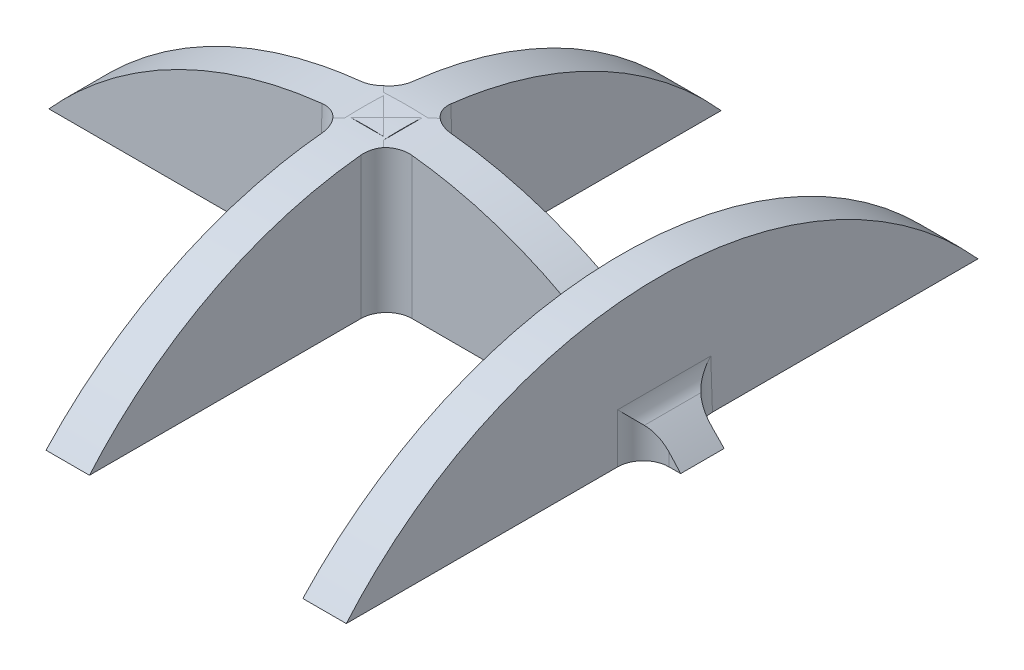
ISO-10303-21;
HEADER;
FILE_DESCRIPTION(('STEP AP214'),'2;1');
FILE_NAME('part.step','',(''),(''),'','','');
FILE_SCHEMA(('AUTOMOTIVE_DESIGN { 1 0 10303 214 1 1 1 1 }'));
ENDSEC;
DATA;
#1=APPLICATION_CONTEXT('core data for automotive mechanical design processes');
#2=APPLICATION_PROTOCOL_DEFINITION('international standard','automotive_design',2000,#1);
#3=PRODUCT_CONTEXT('',#1,'mechanical');
#4=PRODUCT('Part','Part','',(#3));
#5=PRODUCT_RELATED_PRODUCT_CATEGORY('part','',(#4));
#6=PRODUCT_DEFINITION_FORMATION('','',#4);
#7=PRODUCT_DEFINITION_CONTEXT('part definition',#1,'design');
#8=PRODUCT_DEFINITION('design','',#6,#7);
#9=PRODUCT_DEFINITION_SHAPE('','',#8);
#10=(LENGTH_UNIT() NAMED_UNIT(*) SI_UNIT(.MILLI.,.METRE.));
#11=(NAMED_UNIT(*) PLANE_ANGLE_UNIT() SI_UNIT($,.RADIAN.));
#12=(NAMED_UNIT(*) SI_UNIT($,.STERADIAN.) SOLID_ANGLE_UNIT());
#13=UNCERTAINTY_MEASURE_WITH_UNIT(LENGTH_MEASURE(1.E-05),#10,'distance_accuracy_value','');
#14=(GEOMETRIC_REPRESENTATION_CONTEXT(3) GLOBAL_UNCERTAINTY_ASSIGNED_CONTEXT((#13)) GLOBAL_UNIT_ASSIGNED_CONTEXT((#10,
#11,#12)) REPRESENTATION_CONTEXT('',''));
#15=CARTESIAN_POINT('',(0.,0.,0.));
#16=DIRECTION('',(0.,0.,1.));
#17=DIRECTION('',(1.,0.,0.));
#18=AXIS2_PLACEMENT_3D('',#15,#16,#17);
#19=CARTESIAN_POINT('',(1.5,33.,0.226449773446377));
#20=DIRECTION('',(0.999847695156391,0.0174524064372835,0.));
#21=DIRECTION('',(-0.0174524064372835,0.999847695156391,0.));
#22=AXIS2_PLACEMENT_3D('',#19,#20,#21);
#23=PLANE('',#22);
#24=DIRECTION('',(0.,0.,-1.));
#25=VECTOR('',#24,1.);
#26=CARTESIAN_POINT('',(1.69200571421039,22.,-24.3702979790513));
#27=LINE('',#26,#25);
#28=CARTESIAN_POINT('',(1.69200571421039,22.,3.69170110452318));
#29=VERTEX_POINT('',#28);
#30=CARTESIAN_POINT('',(1.6920057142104,22.,24.8231975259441));
#31=VERTEX_POINT('',#30);
#32=EDGE_CURVE('E280',#29,#31,#27,.F.);
#33=ORIENTED_EDGE('',*,*,#32,.F.);
#34=DIRECTION('',(0.0174497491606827,-0.999695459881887,0.0174497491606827));
#35=VECTOR('',#34,1.);
#36=CARTESIAN_POINT('',(1.49900331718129,33.0570999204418,3.49869870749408));
#37=LINE('',#36,#35);
#38=CARTESIAN_POINT('',(1.50284553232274,32.8369795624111,3.50254092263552));
#39=VERTEX_POINT('',#38);
#40=EDGE_CURVE('E379',#29,#39,#37,.F.);
#41=ORIENTED_EDGE('',*,*,#40,.T.);
#42=CARTESIAN_POINT('',(2.07601714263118,0.,0.226449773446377));
#43=DIRECTION('',(0.999847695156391,0.0174524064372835,0.));
#44=DIRECTION('',(0.0174524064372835,-0.999847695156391,0.));
#45=AXIS2_PLACEMENT_3D('',#42,#43,#44);
#46=ELLIPSE('',#45,33.005026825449,33.);
#47=EDGE_CURVE('E278',#31,#39,#46,.F.);
#48=ORIENTED_EDGE('',*,*,#47,.F.);
#49=EDGE_LOOP('',(#33,#41,#48));
#50=FACE_BOUND('',#49,.T.);
#51=ADVANCED_FACE('F29',(#50),#23,.T.);
#52=CARTESIAN_POINT('',(-1.5,33.,0.226449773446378));
#53=DIRECTION('',(-0.999847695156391,0.0174524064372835,0.));
#54=DIRECTION('',(-0.0174524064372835,-0.999847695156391,0.));
#55=AXIS2_PLACEMENT_3D('',#52,#53,#54);
#56=PLANE('',#55);
#57=CARTESIAN_POINT('',(-2.07601714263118,0.,0.226449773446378));
#58=DIRECTION('',(-0.999847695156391,0.0174524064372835,0.));
#59=DIRECTION('',(0.0174524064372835,0.999847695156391,0.));
#60=AXIS2_PLACEMENT_3D('',#57,#58,#59);
#61=ELLIPSE('',#60,33.005026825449,33.);
#62=CARTESIAN_POINT('',(-1.69200571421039,22.,24.8231975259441));
#63=VERTEX_POINT('',#62);
#64=CARTESIAN_POINT('',(-1.50284553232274,32.8369795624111,3.50254092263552));
#65=VERTEX_POINT('',#64);
#66=EDGE_CURVE('E286',#63,#65,#61,.T.);
#67=ORIENTED_EDGE('',*,*,#66,.T.);
#68=DIRECTION('',(-0.0174497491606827,-0.999695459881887,0.0174497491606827));
#69=VECTOR('',#68,1.);
#70=CARTESIAN_POINT('',(-1.6913968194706,22.0348835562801,3.69109220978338));
#71=LINE('',#70,#69);
#72=CARTESIAN_POINT('',(-1.69200571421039,22.,3.69170110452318));
#73=VERTEX_POINT('',#72);
#74=EDGE_CURVE('E375',#65,#73,#71,.T.);
#75=ORIENTED_EDGE('',*,*,#74,.T.);
#76=DIRECTION('',(0.,0.,1.));
#77=VECTOR('',#76,1.);
#78=CARTESIAN_POINT('',(-1.6920057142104,22.,-24.3702979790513));
#79=LINE('',#78,#77);
#80=EDGE_CURVE('E289',#73,#63,#79,.T.);
#81=ORIENTED_EDGE('',*,*,#80,.T.);
#82=EDGE_LOOP('',(#67,#75,#81));
#83=FACE_BOUND('',#82,.T.);
#84=ADVANCED_FACE('F463',(#83),#56,.T.);
#85=CARTESIAN_POINT('',(0.,33.,-1.5));
#86=DIRECTION('',(0.,0.0174524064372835,-0.999847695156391));
#87=DIRECTION('',(0.,0.999847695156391,0.0174524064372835));
#88=AXIS2_PLACEMENT_3D('',#85,#86,#87);
#89=PLANE('',#88);
#90=CARTESIAN_POINT('',(16.4628041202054,30.8865032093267,-1.53689122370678));
#91=DIRECTION('',(0.,0.0174524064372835,-0.999847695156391));
#92=DIRECTION('',(0.,-0.999847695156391,-0.0174524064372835));
#93=AXIS2_PLACEMENT_3D('',#90,#91,#92);
#94=ELLIPSE('',#93,2.00030465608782,2.);
#95=CARTESIAN_POINT('',(15.5220724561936,29.1215601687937,-1.56769841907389));
#96=VERTEX_POINT('',#95);
#97=CARTESIAN_POINT('',(16.4285083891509,28.8867972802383,-1.57179622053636));
#98=VERTEX_POINT('',#97);
#99=EDGE_CURVE('E420',#96,#98,#94,.F.);
#100=ORIENTED_EDGE('',*,*,#99,.T.);
#101=DIRECTION('',(-0.0174497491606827,-0.999695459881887,-0.0174497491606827));
#102=VECTOR('',#101,1.);
#103=CARTESIAN_POINT('',(16.4952803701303,32.7121615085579,-1.50502423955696));
#104=LINE('',#103,#102);
#105=CARTESIAN_POINT('',(16.3082988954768,22.,-1.69200571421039));
#106=VERTEX_POINT('',#105);
#107=EDGE_CURVE('E363',#98,#106,#104,.T.);
#108=ORIENTED_EDGE('',*,*,#107,.T.);
#109=DIRECTION('',(-1.,0.,0.));
#110=VECTOR('',#109,1.);
#111=CARTESIAN_POINT('',(-24.5967477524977,22.,-1.69200571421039));
#112=LINE('',#111,#110);
#113=CARTESIAN_POINT('',(3.69170110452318,22.,-1.69200571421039));
#114=VERTEX_POINT('',#113);
#115=EDGE_CURVE('E329',#114,#106,#112,.F.);
#116=ORIENTED_EDGE('',*,*,#115,.F.);
#117=DIRECTION('',(-0.0174497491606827,0.999695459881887,0.0174497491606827));
#118=VECTOR('',#117,1.);
#119=CARTESIAN_POINT('',(3.49987604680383,32.9896501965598,-1.50018065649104));
#120=LINE('',#119,#118);
#121=CARTESIAN_POINT('',(3.50294981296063,32.8135542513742,-1.50325442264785));
#122=VERTEX_POINT('',#121);
#123=EDGE_CURVE('E361',#114,#122,#120,.T.);
#124=ORIENTED_EDGE('',*,*,#123,.T.);
#125=CARTESIAN_POINT('',(0.,0.,-2.07601714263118));
#126=DIRECTION('',(0.,0.0174524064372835,-0.999847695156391));
#127=DIRECTION('',(0.,-0.999847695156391,-0.0174524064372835));
#128=AXIS2_PLACEMENT_3D('',#125,#126,#127);
#129=ELLIPSE('',#128,33.005026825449,33.);
#130=EDGE_CURVE('E325',#96,#122,#129,.F.);
#131=ORIENTED_EDGE('',*,*,#130,.F.);
#132=EDGE_LOOP('',(#100,#108,#116,#124,#131));
#133=FACE_BOUND('',#132,.T.);
#134=ADVANCED_FACE('F472',(#133),#89,.T.);
#135=CARTESIAN_POINT('',(-3.50294981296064,32.8135542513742,-1.50325442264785));
#136=VERTEX_POINT('',#135);
#137=CARTESIAN_POINT('',(-24.5967477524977,22.,-1.69200571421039));
#138=VERTEX_POINT('',#137);
#139=EDGE_CURVE('E277',#136,#138,#129,.F.);
#140=ORIENTED_EDGE('',*,*,#139,.F.);
#141=DIRECTION('',(-0.0174497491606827,-0.999695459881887,-0.0174497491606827));
#142=VECTOR('',#141,1.);
#143=CARTESIAN_POINT('',(-3.49862975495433,33.0610502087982,-1.49893436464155));
#144=LINE('',#143,#142);
#145=CARTESIAN_POINT('',(-3.69170110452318,22.,-1.69200571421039));
#146=VERTEX_POINT('',#145);
#147=EDGE_CURVE('E359',#136,#146,#144,.T.);
#148=ORIENTED_EDGE('',*,*,#147,.T.);
#149=EDGE_CURVE('E326',#138,#146,#112,.F.);
#150=ORIENTED_EDGE('',*,*,#149,.F.);
#151=EDGE_LOOP('',(#140,#148,#150));
#152=FACE_BOUND('',#151,.T.);
#153=ADVANCED_FACE('F633',(#152),#89,.T.);
#154=CARTESIAN_POINT('',(0.,0.,1.5));
#155=DIRECTION('',(0.,0.,-1.));
#156=DIRECTION('',(-1.,0.,0.));
#157=AXIS2_PLACEMENT_3D('',#154,#155,#156);
#158=CYLINDRICAL_SURFACE('',#157,33.);
#159=CARTESIAN_POINT('',(23.6744276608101,22.9895949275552,-1.67473227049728));
#160=CARTESIAN_POINT('',(23.5970089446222,23.0693281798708,-1.6733632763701));
#161=CARTESIAN_POINT('',(23.5191105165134,23.1487331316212,-1.67629203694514));
#162=CARTESIAN_POINT('',(23.3627919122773,23.3064842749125,-1.69124154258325));
#163=CARTESIAN_POINT('',(23.2843709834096,23.3848278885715,-1.7032813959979));
#164=CARTESIAN_POINT('',(23.1301055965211,23.5374096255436,-1.73645834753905));
#165=CARTESIAN_POINT('',(23.0542539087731,23.6117005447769,-1.75731408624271));
#166=CARTESIAN_POINT('',(22.9036030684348,23.7578612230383,-1.80860705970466));
#167=CARTESIAN_POINT('',(22.8288029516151,23.8297332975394,-1.83903482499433));
#168=CARTESIAN_POINT('',(22.6720332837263,23.9789902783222,-1.91451080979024));
#169=CARTESIAN_POINT('',(22.5903056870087,24.0559744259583,-1.96089197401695));
#170=CARTESIAN_POINT('',(22.4702348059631,24.1679876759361,-2.04129381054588));
#171=CARTESIAN_POINT('',(22.4303076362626,24.2050437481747,-2.07018851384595));
#172=CARTESIAN_POINT('',(22.351820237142,24.277540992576,-2.1317055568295));
#173=CARTESIAN_POINT('',(22.3132609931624,24.3129810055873,-2.16433051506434));
#174=CARTESIAN_POINT('',(22.2755450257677,24.3474863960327,-2.19887554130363));
#175=B_SPLINE_CURVE_WITH_KNOTS('',3,(#159,#160,#161,#162,#163,#164,#165,#166,#167,#168,#169,
#170,#171,#172,#173,#174),.UNSPECIFIED.,.F.,.F.,(4,2,2,2,2,2,2,4),(0.,0.333414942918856,
0.667531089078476,0.991705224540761,1.31555966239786,1.67902059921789,1.86387605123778,
2.04886207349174),.UNSPECIFIED.);
#176=CARTESIAN_POINT('',(23.6744276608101,22.9895949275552,-1.67473227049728));
#177=VERTEX_POINT('',#176);
#178=CARTESIAN_POINT('',(22.2755450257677,24.3474863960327,-2.19887554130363));
#179=VERTEX_POINT('',#178);
#180=EDGE_CURVE('E383',#177,#179,#175,.T.);
#181=ORIENTED_EDGE('',*,*,#180,.T.);
#182=DIRECTION('',(0.,0.,-1.));
#183=VECTOR('',#182,1.);
#184=CARTESIAN_POINT('',(22.2755450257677,24.3474863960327,1.5));
#185=LINE('',#184,#183);
#186=CARTESIAN_POINT('',(22.2755450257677,24.3474863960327,2.19887554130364));
#187=VERTEX_POINT('',#186);
#188=EDGE_CURVE('E346',#179,#187,#185,.F.);
#189=ORIENTED_EDGE('',*,*,#188,.T.);
#190=CARTESIAN_POINT('',(22.2755450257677,24.3474863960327,2.19887554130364));
#191=CARTESIAN_POINT('',(22.3282730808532,24.2992511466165,2.1505920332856));
#192=CARTESIAN_POINT('',(22.3826349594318,24.2491954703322,2.10605567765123));
#193=CARTESIAN_POINT('',(22.4937555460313,24.1461511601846,2.02421230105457));
#194=CARTESIAN_POINT('',(22.5505100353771,24.0931676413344,1.98689315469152));
#195=CARTESIAN_POINT('',(22.6644844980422,23.9859782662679,1.91979055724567));
#196=CARTESIAN_POINT('',(22.7216679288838,23.9318235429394,1.88986172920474));
#197=CARTESIAN_POINT('',(22.8371554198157,23.8216435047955,1.83617377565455));
#198=CARTESIAN_POINT('',(22.8954599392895,23.7656174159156,1.81241723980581));
#199=CARTESIAN_POINT('',(23.0130458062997,23.6517749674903,1.77066393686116));
#200=CARTESIAN_POINT('',(23.07233080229,23.593950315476,1.75270029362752));
#201=CARTESIAN_POINT('',(23.1911847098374,23.4771356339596,1.72243241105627));
#202=CARTESIAN_POINT('',(23.2507536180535,23.4181456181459,1.71012810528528));
#203=CARTESIAN_POINT('',(23.3712133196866,23.2979351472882,1.69071237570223));
#204=CARTESIAN_POINT('',(23.4321035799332,23.2366944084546,1.68372452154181));
#205=CARTESIAN_POINT('',(23.5535652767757,23.1135690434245,1.67519784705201));
#206=CARTESIAN_POINT('',(23.6141368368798,23.0516846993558,1.67365673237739));
#207=CARTESIAN_POINT('',(23.6744276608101,22.9895949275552,1.67473227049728));
#208=B_SPLINE_CURVE_WITH_KNOTS('',3,(#190,#191,#192,#193,#194,#195,#196,#197,#198,#199,#200,
#201,#202,#203,#204,#205,#206,#207),.UNSPECIFIED.,.F.,.F.,(4,2,2,2,2,2,2,2,4),(0.,
0.258502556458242,0.516566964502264,0.7690564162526,1.02165163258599,1.27566658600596,
1.5296785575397,1.78942792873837,2.04906787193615),.UNSPECIFIED.);
#209=CARTESIAN_POINT('',(23.6744276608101,22.9895949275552,1.67473227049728));
#210=VERTEX_POINT('',#209);
#211=EDGE_CURVE('E415',#187,#210,#208,.T.);
#212=ORIENTED_EDGE('',*,*,#211,.T.);
#213=CARTESIAN_POINT('',(0.,0.,2.07601714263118));
#214=DIRECTION('',(0.,0.0174524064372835,0.999847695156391));
#215=DIRECTION('',(0.,0.999847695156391,-0.0174524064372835));
#216=AXIS2_PLACEMENT_3D('',#213,#214,#215);
#217=ELLIPSE('',#216,33.005026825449,33.);
#218=CARTESIAN_POINT('',(24.5967477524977,22.,1.69200571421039));
#219=VERTEX_POINT('',#218);
#220=EDGE_CURVE('E330',#219,#210,#217,.T.);
#221=ORIENTED_EDGE('',*,*,#220,.F.);
#222=DIRECTION('',(0.,0.,-1.));
#223=VECTOR('',#222,1.);
#224=CARTESIAN_POINT('',(24.5967477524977,22.,1.5));
#225=LINE('',#224,#223);
#226=CARTESIAN_POINT('',(24.5967477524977,22.,-1.69200571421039));
#227=VERTEX_POINT('',#226);
#228=EDGE_CURVE('E314',#219,#227,#225,.T.);
#229=ORIENTED_EDGE('',*,*,#228,.T.);
#230=EDGE_CURVE('E321',#227,#177,#129,.F.);
#231=ORIENTED_EDGE('',*,*,#230,.T.);
#232=EDGE_LOOP('',(#181,#189,#212,#221,#229,#231));
#233=FACE_BOUND('',#232,.T.);
#234=ADVANCED_FACE('F602',(#233),#158,.T.);
#235=CARTESIAN_POINT('',(23.6917011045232,22.,-1.69200571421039));
#236=VERTEX_POINT('',#235);
#237=EDGE_CURVE('E324',#236,#227,#112,.F.);
#238=ORIENTED_EDGE('',*,*,#237,.F.);
#239=DIRECTION('',(-0.0174497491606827,0.999695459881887,0.0174497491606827));
#240=VECTOR('',#239,1.);
#241=CARTESIAN_POINT('',(23.6402446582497,24.9479378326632,-1.64054926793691));
#242=LINE('',#241,#240);
#243=EDGE_CURVE('E344',#236,#177,#242,.T.);
#244=ORIENTED_EDGE('',*,*,#243,.T.);
#245=ORIENTED_EDGE('',*,*,#230,.F.);
#246=EDGE_LOOP('',(#238,#244,#245));
#247=FACE_BOUND('',#246,.T.);
#248=ADVANCED_FACE('F635',(#247),#89,.T.);
#249=CARTESIAN_POINT('',(0.,33.,1.5));
#250=DIRECTION('',(0.,0.0174524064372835,0.999847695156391));
#251=DIRECTION('',(0.,-0.999847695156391,0.0174524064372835));
#252=AXIS2_PLACEMENT_3D('',#249,#250,#251);
#253=PLANE('',#252);
#254=ORIENTED_EDGE('',*,*,#220,.T.);
#255=DIRECTION('',(-0.0174497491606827,0.999695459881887,-0.0174497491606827));
#256=VECTOR('',#255,1.);
#257=CARTESIAN_POINT('',(23.4925398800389,33.4099389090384,1.49284448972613));
#258=LINE('',#257,#256);
#259=CARTESIAN_POINT('',(23.6917011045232,22.,1.69200571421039));
#260=VERTEX_POINT('',#259);
#261=EDGE_CURVE('E348',#210,#260,#258,.F.);
#262=ORIENTED_EDGE('',*,*,#261,.T.);
#263=DIRECTION('',(1.,0.,0.));
#264=VECTOR('',#263,1.);
#265=CARTESIAN_POINT('',(-24.5967477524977,22.,1.69200571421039));
#266=LINE('',#265,#264);
#267=EDGE_CURVE('E333',#260,#219,#266,.T.);
#268=ORIENTED_EDGE('',*,*,#267,.T.);
#269=EDGE_LOOP('',(#254,#262,#268));
#270=FACE_BOUND('',#269,.T.);
#271=ADVANCED_FACE('F595',(#270),#253,.T.);
#272=CARTESIAN_POINT('',(18.5,0.,0.226449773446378));
#273=DIRECTION('',(1.,0.,0.));
#274=DIRECTION('',(0.,0.,-1.));
#275=AXIS2_PLACEMENT_3D('',#272,#273,#274);
#276=CYLINDRICAL_SURFACE('',#275,33.);
#277=CARTESIAN_POINT('',(22.0760171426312,0.,0.226449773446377));
#278=DIRECTION('',(0.999847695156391,0.0174524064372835,0.));
#279=DIRECTION('',(0.0174524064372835,-0.999847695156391,0.));
#280=AXIS2_PLACEMENT_3D('',#277,#278,#279);
#281=ELLIPSE('',#280,33.005026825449,33.);
#282=CARTESIAN_POINT('',(21.6920057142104,22.,24.8231975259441));
#283=VERTEX_POINT('',#282);
#284=CARTESIAN_POINT('',(21.6920057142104,22.,-24.3702979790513));
#285=VERTEX_POINT('',#284);
#286=EDGE_CURVE('E238',#283,#285,#281,.F.);
#287=ORIENTED_EDGE('',*,*,#286,.T.);
#288=DIRECTION('',(1.,0.,0.));
#289=VECTOR('',#288,1.);
#290=CARTESIAN_POINT('',(18.5,22.,-24.3702979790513));
#291=LINE('',#290,#289);
#292=CARTESIAN_POINT('',(18.3079942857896,22.,-24.3702979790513));
#293=VERTEX_POINT('',#292);
#294=EDGE_CURVE('E246',#293,#285,#291,.T.);
#295=ORIENTED_EDGE('',*,*,#294,.F.);
#296=CARTESIAN_POINT('',(17.9239828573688,0.,0.226449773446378));
#297=DIRECTION('',(-0.999847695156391,0.0174524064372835,0.));
#298=DIRECTION('',(0.0174524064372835,0.999847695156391,0.));
#299=AXIS2_PLACEMENT_3D('',#296,#297,#298);
#300=ELLIPSE('',#299,33.005026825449,33.);
#301=CARTESIAN_POINT('',(18.3079942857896,22.,24.8231975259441));
#302=VERTEX_POINT('',#301);
#303=EDGE_CURVE('E242',#302,#293,#300,.T.);
#304=ORIENTED_EDGE('',*,*,#303,.F.);
#305=DIRECTION('',(1.,0.,0.));
#306=VECTOR('',#305,1.);
#307=CARTESIAN_POINT('',(18.5,22.,24.8231975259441));
#308=LINE('',#307,#306);
#309=EDGE_CURVE('E255',#302,#283,#308,.T.);
#310=ORIENTED_EDGE('',*,*,#309,.T.);
#311=EDGE_LOOP('',(#287,#295,#304,#310));
#312=FACE_BOUND('',#311,.T.);
#313=ADVANCED_FACE('F258',(#312),#276,.T.);
#314=CARTESIAN_POINT('',(21.5,33.,0.226449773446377));
#315=DIRECTION('',(0.999847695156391,0.0174524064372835,0.));
#316=DIRECTION('',(-0.0174524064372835,0.999847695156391,0.));
#317=AXIS2_PLACEMENT_3D('',#314,#315,#316);
#318=PLANE('',#317);
#319=DIRECTION('',(0.,0.,-1.));
#320=VECTOR('',#319,1.);
#321=CARTESIAN_POINT('',(21.6258826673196,25.7881868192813,-1.6411581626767));
#322=LINE('',#321,#320);
#323=CARTESIAN_POINT('',(21.6258826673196,25.7881868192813,3.6255780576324));
#324=VERTEX_POINT('',#323);
#325=CARTESIAN_POINT('',(21.6258826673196,25.7881868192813,-3.6255780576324));
#326=VERTEX_POINT('',#325);
#327=EDGE_CURVE('E341',#324,#326,#322,.T.);
#328=ORIENTED_EDGE('',*,*,#327,.T.);
#329=DIRECTION('',(-0.0174497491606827,0.999695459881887,0.0174497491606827));
#330=VECTOR('',#329,1.);
#331=CARTESIAN_POINT('',(21.6913968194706,22.0348835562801,-3.69109220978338));
#332=LINE('',#331,#330);
#333=CARTESIAN_POINT('',(21.6920057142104,22.,-3.69170110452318));
#334=VERTEX_POINT('',#333);
#335=EDGE_CURVE('E240',#326,#334,#332,.F.);
#336=ORIENTED_EDGE('',*,*,#335,.T.);
#337=DIRECTION('',(0.,0.,-1.));
#338=VECTOR('',#337,1.);
#339=CARTESIAN_POINT('',(21.6920057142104,22.,-24.3702979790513));
#340=LINE('',#339,#338);
#341=EDGE_CURVE('E233',#285,#334,#340,.F.);
#342=ORIENTED_EDGE('',*,*,#341,.F.);
#343=ORIENTED_EDGE('',*,*,#286,.F.);
#344=CARTESIAN_POINT('',(21.6920057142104,22.,3.69170110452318));
#345=VERTEX_POINT('',#344);
#346=EDGE_CURVE('E243',#345,#283,#340,.F.);
#347=ORIENTED_EDGE('',*,*,#346,.F.);
#348=DIRECTION('',(0.0174497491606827,-0.999695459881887,0.0174497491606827));
#349=VECTOR('',#348,1.);
#350=CARTESIAN_POINT('',(21.4990033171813,33.0570999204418,3.49869870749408));
#351=LINE('',#350,#349);
#352=EDGE_CURVE('E309',#345,#324,#351,.F.);
#353=ORIENTED_EDGE('',*,*,#352,.T.);
#354=EDGE_LOOP('',(#328,#336,#342,#343,#347,#353));
#355=FACE_BOUND('',#354,.T.);
#356=ADVANCED_FACE('F235',(#355),#318,.T.);
#357=CARTESIAN_POINT('',(18.5,33.,0.226449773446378));
#358=DIRECTION('',(-0.999847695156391,0.0174524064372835,0.));
#359=DIRECTION('',(-0.0174524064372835,-0.999847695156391,0.));
#360=AXIS2_PLACEMENT_3D('',#357,#358,#359);
#361=PLANE('',#360);
#362=DIRECTION('',(0.,0.,1.));
#363=VECTOR('',#362,1.);
#364=CARTESIAN_POINT('',(18.3079942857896,22.,-24.3702979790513));
#365=LINE('',#364,#363);
#366=CARTESIAN_POINT('',(18.3079942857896,22.,-3.69170110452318));
#367=VERTEX_POINT('',#366);
#368=EDGE_CURVE('E250',#293,#367,#365,.T.);
#369=ORIENTED_EDGE('',*,*,#368,.T.);
#370=DIRECTION('',(0.0174497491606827,0.999695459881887,0.0174497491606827));
#371=VECTOR('',#370,1.);
#372=CARTESIAN_POINT('',(18.5011345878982,33.0650004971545,-3.49856080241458));
#373=LINE('',#372,#371);
#374=CARTESIAN_POINT('',(18.4624995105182,30.8515983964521,-3.5371958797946));
#375=VERTEX_POINT('',#374);
#376=EDGE_CURVE('E357',#367,#375,#373,.T.);
#377=ORIENTED_EDGE('',*,*,#376,.T.);
#378=DIRECTION('',(0.,0.,-1.));
#379=VECTOR('',#378,1.);
#380=CARTESIAN_POINT('',(18.4624995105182,30.8515983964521,0.226449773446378));
#381=LINE('',#380,#379);
#382=CARTESIAN_POINT('',(18.4624995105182,30.8515983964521,3.5371958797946));
#383=VERTEX_POINT('',#382);
#384=EDGE_CURVE('E355',#375,#383,#381,.F.);
#385=ORIENTED_EDGE('',*,*,#384,.T.);
#386=DIRECTION('',(-0.0174497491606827,-0.999695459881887,0.0174497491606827));
#387=VECTOR('',#386,1.);
#388=CARTESIAN_POINT('',(18.3086031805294,22.0348835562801,3.69109220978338));
#389=LINE('',#388,#387);
#390=CARTESIAN_POINT('',(18.3079942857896,22.,3.69170110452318));
#391=VERTEX_POINT('',#390);
#392=EDGE_CURVE('E353',#383,#391,#389,.T.);
#393=ORIENTED_EDGE('',*,*,#392,.T.);
#394=EDGE_CURVE('E268',#391,#302,#365,.T.);
#395=ORIENTED_EDGE('',*,*,#394,.T.);
#396=ORIENTED_EDGE('',*,*,#303,.T.);
#397=EDGE_LOOP('',(#369,#377,#385,#393,#395,#396));
#398=FACE_BOUND('',#397,.T.);
#399=ADVANCED_FACE('F526',(#398),#361,.T.);
#400=CARTESIAN_POINT('',(15.5220724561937,29.1215601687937,1.56769841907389));
#401=VERTEX_POINT('',#400);
#402=CARTESIAN_POINT('',(3.50294981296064,32.8135542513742,1.50325442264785));
#403=VERTEX_POINT('',#402);
#404=EDGE_CURVE('E334',#401,#403,#217,.T.);
#405=ORIENTED_EDGE('',*,*,#404,.F.);
#406=DIRECTION('',(0.,0.,-1.));
#407=VECTOR('',#406,1.);
#408=CARTESIAN_POINT('',(15.5220724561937,29.1215601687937,1.5));
#409=LINE('',#408,#407);
#410=EDGE_CURVE('E350',#401,#96,#409,.T.);
#411=ORIENTED_EDGE('',*,*,#410,.T.);
#412=ORIENTED_EDGE('',*,*,#130,.T.);
#413=CARTESIAN_POINT('',(3.50294981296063,32.8135542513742,-1.50325442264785));
#414=CARTESIAN_POINT('',(3.44669158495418,32.8195608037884,-1.50314998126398));
#415=CARTESIAN_POINT('',(3.39043924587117,32.8254185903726,-1.50541336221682));
#416=CARTESIAN_POINT('',(3.27829149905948,32.8368082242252,-1.5146645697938));
#417=CARTESIAN_POINT('',(3.22239609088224,32.8423400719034,-1.52165239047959));
#418=CARTESIAN_POINT('',(3.0560055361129,32.8583807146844,-1.54964488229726));
#419=CARTESIAN_POINT('',(2.9465571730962,32.8683611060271,-1.57767826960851));
#420=CARTESIAN_POINT('',(2.73375558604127,32.8867455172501,-1.65183404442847));
#421=CARTESIAN_POINT('',(2.63040878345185,32.8951478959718,-1.69797511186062));
#422=CARTESIAN_POINT('',(2.43289661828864,32.9103453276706,-1.80707274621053));
#423=CARTESIAN_POINT('',(2.33872979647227,32.917140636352,-1.87002663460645));
#424=CARTESIAN_POINT('',(2.16285130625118,32.9291634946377,-2.01059429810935));
#425=CARTESIAN_POINT('',(2.0810648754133,32.9344006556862,-2.08811317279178));
#426=CARTESIAN_POINT('',(1.96898797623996,32.9412279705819,-2.21388182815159));
#427=CARTESIAN_POINT('',(1.93335503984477,32.9433344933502,-2.25745199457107));
#428=CARTESIAN_POINT('',(1.86588391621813,32.9472246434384,-2.34745525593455));
#429=CARTESIAN_POINT('',(1.83404595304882,32.949008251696,-2.3938885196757));
#430=CARTESIAN_POINT('',(1.80421117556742,32.9506422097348,-2.4416109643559));
#431=B_SPLINE_CURVE_WITH_KNOTS('',3,(#413,#414,#415,#416,#417,#418,#419,#420,#421,#422,#423,
#424,#425,#426,#427,#428,#429,#430),.UNSPECIFIED.,.F.,.F.,(4,2,2,2,2,2,2,2,4),(0.,
0.169632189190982,0.339264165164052,0.677786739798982,1.01665945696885,1.3554782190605,
1.69216144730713,1.86096151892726,2.0297715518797),.UNSPECIFIED.);
#432=CARTESIAN_POINT('',(2.20471331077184,32.9262697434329,-1.97826353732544));
#433=VERTEX_POINT('',#432);
#434=EDGE_CURVE('E51',#122,#433,#431,.T.);
#435=ORIENTED_EDGE('',*,*,#434,.T.);
#436=CARTESIAN_POINT('',(0.,0.,0.226449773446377));
#437=DIRECTION('',(-0.707106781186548,0.,-0.707106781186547));
#438=DIRECTION('',(0.707106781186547,0.,-0.707106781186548));
#439=AXIS2_PLACEMENT_3D('',#436,#437,#438);
#440=ELLIPSE('',#439,46.6690475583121,33.);
#441=CARTESIAN_POINT('',(1.7272393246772,32.9547666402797,-1.50078955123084));
#442=VERTEX_POINT('',#441);
#443=EDGE_CURVE('E37',#442,#433,#440,.T.);
#444=ORIENTED_EDGE('',*,*,#443,.F.);
#445=CARTESIAN_POINT('',(-1.7272393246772,32.9547666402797,-1.50078955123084));
#446=VERTEX_POINT('',#445);
#447=EDGE_CURVE('E628',#442,#446,#129,.F.);
#448=ORIENTED_EDGE('',*,*,#447,.T.);
#449=CARTESIAN_POINT('',(0.,0.,0.226449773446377));
#450=DIRECTION('',(0.707106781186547,0.,-0.707106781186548));
#451=DIRECTION('',(-0.707106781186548,0.,-0.707106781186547));
#452=AXIS2_PLACEMENT_3D('',#449,#450,#451);
#453=ELLIPSE('',#452,46.6690475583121,33.);
#454=CARTESIAN_POINT('',(-2.20471331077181,32.9262697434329,-1.97826353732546));
#455=VERTEX_POINT('',#454);
#456=EDGE_CURVE('E575',#446,#455,#453,.F.);
#457=ORIENTED_EDGE('',*,*,#456,.T.);
#458=CARTESIAN_POINT('',(-1.95873084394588,32.9418180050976,-2.22741542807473));
#459=CARTESIAN_POINT('',(-1.9944599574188,32.9396933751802,-2.18422808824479));
#460=CARTESIAN_POINT('',(-2.0319878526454,32.9374037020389,-2.14257235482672));
#461=CARTESIAN_POINT('',(-2.11039798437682,32.932472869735,-2.0625738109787));
#462=CARTESIAN_POINT('',(-2.15128007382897,32.9298317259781,-2.02423085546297));
#463=CARTESIAN_POINT('',(-2.27845918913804,32.9213579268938,-1.91465960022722));
#464=CARTESIAN_POINT('',(-2.36940733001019,32.9149681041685,-1.84874628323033));
#465=CARTESIAN_POINT('',(-2.56103625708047,32.9006130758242,-1.733054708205));
#466=CARTESIAN_POINT('',(-2.66173103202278,32.8926455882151,-1.68330010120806));
#467=CARTESIAN_POINT('',(-2.86986407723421,32.8751387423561,-1.60137819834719));
#468=CARTESIAN_POINT('',(-2.97729653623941,32.8656007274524,-1.56919597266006));
#469=CARTESIAN_POINT('',(-3.15502240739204,32.8489053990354,-1.53177703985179));
#470=CARTESIAN_POINT('',(-3.2242359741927,32.8421855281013,-1.52096811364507));
#471=CARTESIAN_POINT('',(-3.36328391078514,32.8282384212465,-1.50664293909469));
#472=CARTESIAN_POINT('',(-3.43311749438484,32.8210117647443,-1.50311849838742));
#473=CARTESIAN_POINT('',(-3.50294981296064,32.8135542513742,-1.50325442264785));
#474=B_SPLINE_CURVE_WITH_KNOTS('',3,(#458,#459,#460,#461,#462,#463,#464,#465,#466,#467,#468,
#469,#470,#471,#472,#473),.UNSPECIFIED.,.F.,.F.,(4,2,2,2,2,2,2,4),(0.,0.16816977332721,
0.336332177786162,0.672107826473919,1.00837274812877,1.3443515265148,1.55512172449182,
1.76565475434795),.UNSPECIFIED.);
#475=EDGE_CURVE('E508',#455,#136,#474,.T.);
#476=ORIENTED_EDGE('',*,*,#475,.T.);
#477=ORIENTED_EDGE('',*,*,#139,.T.);
#478=DIRECTION('',(0.,0.,-1.));
#479=VECTOR('',#478,1.);
#480=CARTESIAN_POINT('',(-24.5967477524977,22.,1.5));
#481=LINE('',#480,#479);
#482=CARTESIAN_POINT('',(-24.5967477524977,22.,1.69200571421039));
#483=VERTEX_POINT('',#482);
#484=EDGE_CURVE('E317',#483,#138,#481,.T.);
#485=ORIENTED_EDGE('',*,*,#484,.F.);
#486=CARTESIAN_POINT('',(-3.50294981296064,32.8135542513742,1.50325442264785));
#487=VERTEX_POINT('',#486);
#488=EDGE_CURVE('E328',#487,#483,#217,.T.);
#489=ORIENTED_EDGE('',*,*,#488,.F.);
#490=CARTESIAN_POINT('',(-3.50294981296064,32.8135542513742,1.50325442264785));
#491=CARTESIAN_POINT('',(-3.44671369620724,32.8195584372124,1.50315013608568));
#492=CARTESIAN_POINT('',(-3.39048360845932,32.8254139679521,1.50541163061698));
#493=CARTESIAN_POINT('',(-3.27837996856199,32.8367993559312,1.51465534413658));
#494=CARTESIAN_POINT('',(-3.22250641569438,32.8423292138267,1.52163755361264));
#495=CARTESIAN_POINT('',(-3.05609205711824,32.8583728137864,1.54962292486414));
#496=CARTESIAN_POINT('',(-2.94659851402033,32.8683575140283,1.5776646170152));
#497=CARTESIAN_POINT('',(-2.73374946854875,32.8867460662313,1.6518354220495));
#498=CARTESIAN_POINT('',(-2.6303983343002,32.8951488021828,1.69797723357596));
#499=CARTESIAN_POINT('',(-2.43288196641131,32.9103463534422,1.80708448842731));
#500=CARTESIAN_POINT('',(-2.33871411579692,32.9171416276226,1.87004511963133));
#501=CARTESIAN_POINT('',(-2.16278900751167,32.9291678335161,2.01063816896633));
#502=CARTESIAN_POINT('',(-2.08096725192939,32.934407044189,2.08818921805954));
#503=CARTESIAN_POINT('',(-1.93147632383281,32.9435125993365,2.25600966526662));
#504=CARTESIAN_POINT('',(-1.8638100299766,32.9473786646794,2.34628164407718));
#505=CARTESIAN_POINT('',(-1.74478494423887,32.9538963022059,2.53666417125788));
#506=CARTESIAN_POINT('',(-1.69337948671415,32.9565513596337,2.63674546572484));
#507=CARTESIAN_POINT('',(-1.60809609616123,32.9608231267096,2.84410912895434));
#508=CARTESIAN_POINT('',(-1.5742079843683,32.9624404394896,2.95138727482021));
#509=CARTESIAN_POINT('',(-1.53328108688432,32.9643642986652,3.13280877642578));
#510=CARTESIAN_POINT('',(-1.52103101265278,32.964929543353,3.20581678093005));
#511=CARTESIAN_POINT('',(-1.50468931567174,32.9656780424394,3.35263688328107));
#512=CARTESIAN_POINT('',(-1.50058612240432,32.9658618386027,3.42644769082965));
#513=CARTESIAN_POINT('',(-1.50059584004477,32.9658643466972,3.50029123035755));
#514=B_SPLINE_CURVE_WITH_KNOTS('',3,(#490,#491,#492,#493,#494,#495,#496,#497,#498,#499,#500,
#501,#502,#503,#504,#505,#506,#507,#508,#509,#510,#511,#512,#513),.UNSPECIFIED.,.F.,.F.,(4,2,2,
2,2,2,2,2,2,2,2,4),(0.,0.169565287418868,0.339130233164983,0.677786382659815,1.01668055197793,
1.35547786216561,1.69243892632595,2.02946844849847,2.36552179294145,2.70137964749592,
2.92304729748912,3.14439990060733),.UNSPECIFIED.);
#515=CARTESIAN_POINT('',(-1.97801225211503,32.9406658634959,2.20446202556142));
#516=VERTEX_POINT('',#515);
#517=EDGE_CURVE('E554',#487,#516,#514,.T.);
#518=ORIENTED_EDGE('',*,*,#517,.T.);
#519=CARTESIAN_POINT('',(0.,0.,0.226449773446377));
#520=DIRECTION('',(0.707106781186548,0.,0.707106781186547));
#521=DIRECTION('',(0.707106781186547,0.,-0.707106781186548));
#522=AXIS2_PLACEMENT_3D('',#519,#520,#521);
#523=ELLIPSE('',#522,46.6690475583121,33.);
#524=CARTESIAN_POINT('',(-1.50059584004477,32.9658643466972,1.72704561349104));
#525=VERTEX_POINT('',#524);
#526=EDGE_CURVE('E572',#525,#516,#523,.T.);
#527=ORIENTED_EDGE('',*,*,#526,.F.);
#528=DIRECTION('',(0.,0.,-1.));
#529=VECTOR('',#528,1.);
#530=CARTESIAN_POINT('',(-1.50059584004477,32.9658643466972,1.5));
#531=LINE('',#530,#529);
#532=CARTESIAN_POINT('',(-1.50059584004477,32.9658643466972,-1.27414606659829));
#533=VERTEX_POINT('',#532);
#534=EDGE_CURVE('E298',#525,#533,#531,.T.);
#535=ORIENTED_EDGE('',*,*,#534,.T.);
#536=CARTESIAN_POINT('',(0.,0.,0.226449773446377));
#537=DIRECTION('',(0.707106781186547,0.,-0.707106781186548));
#538=DIRECTION('',(-0.707106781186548,0.,-0.707106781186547));
#539=AXIS2_PLACEMENT_3D('',#536,#537,#538);
#540=ELLIPSE('',#539,46.6690475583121,33.);
#541=CARTESIAN_POINT('',(0.,33.,0.226449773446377));
#542=VERTEX_POINT('',#541);
#543=EDGE_CURVE('E301',#542,#533,#540,.F.);
#544=ORIENTED_EDGE('',*,*,#543,.F.);
#545=CARTESIAN_POINT('',(0.,0.,0.226449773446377));
#546=DIRECTION('',(-0.707106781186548,0.,-0.707106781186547));
#547=DIRECTION('',(0.707106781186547,0.,-0.707106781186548));
#548=AXIS2_PLACEMENT_3D('',#545,#546,#547);
#549=ELLIPSE('',#548,46.6690475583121,33.);
#550=CARTESIAN_POINT('',(1.50059584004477,32.9658643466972,-1.27414606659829));
#551=VERTEX_POINT('',#550);
#552=EDGE_CURVE('E296',#551,#542,#549,.F.);
#553=ORIENTED_EDGE('',*,*,#552,.F.);
#554=DIRECTION('',(0.,0.,-1.));
#555=VECTOR('',#554,1.);
#556=CARTESIAN_POINT('',(1.50059584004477,32.9658643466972,1.5));
#557=LINE('',#556,#555);
#558=CARTESIAN_POINT('',(1.50059584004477,32.9658643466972,1.72704561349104));
#559=VERTEX_POINT('',#558);
#560=EDGE_CURVE('E293',#559,#551,#557,.T.);
#561=ORIENTED_EDGE('',*,*,#560,.F.);
#562=CARTESIAN_POINT('',(0.,0.,0.226449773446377));
#563=DIRECTION('',(0.707106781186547,0.,-0.707106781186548));
#564=DIRECTION('',(0.707106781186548,0.,0.707106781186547));
#565=AXIS2_PLACEMENT_3D('',#562,#563,#564);
#566=ELLIPSE('',#565,46.6690475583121,33.);
#567=CARTESIAN_POINT('',(1.97801225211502,32.9406658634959,2.20446202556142));
#568=VERTEX_POINT('',#567);
#569=EDGE_CURVE('E11',#559,#568,#566,.T.);
#570=ORIENTED_EDGE('',*,*,#569,.T.);
#571=CARTESIAN_POINT('',(1.50059584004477,32.9658643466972,3.50029123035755));
#572=CARTESIAN_POINT('',(1.50059618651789,32.9658635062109,3.4441634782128));
#573=CARTESIAN_POINT('',(1.50296159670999,32.9657567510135,3.3880625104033));
#574=CARTESIAN_POINT('',(1.51239932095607,32.9653254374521,3.27626122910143));
#575=CARTESIAN_POINT('',(1.51947143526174,32.9650008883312,3.22056089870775));
#576=CARTESIAN_POINT('',(1.54768278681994,32.9636929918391,3.05475364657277));
#577=CARTESIAN_POINT('',(1.57581720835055,32.9623754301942,2.94575628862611));
#578=CARTESIAN_POINT('',(1.64996360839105,32.9587466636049,2.73403910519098));
#579=CARTESIAN_POINT('',(1.69598465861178,32.9564349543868,2.63132249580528));
#580=CARTESIAN_POINT('',(1.80458564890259,32.950666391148,2.43509431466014));
#581=CARTESIAN_POINT('',(1.86716247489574,32.9472097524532,2.34158101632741));
#582=CARTESIAN_POINT('',(2.00703345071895,32.938984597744,2.16647242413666));
#583=CARTESIAN_POINT('',(2.08431786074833,32.9342169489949,2.08486930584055));
#584=CARTESIAN_POINT('',(2.25142256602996,32.9232150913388,1.93579264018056));
#585=CARTESIAN_POINT('',(2.34124489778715,32.9169806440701,1.86832139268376));
#586=CARTESIAN_POINT('',(2.53087713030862,32.9029435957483,1.74936830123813));
#587=CARTESIAN_POINT('',(2.63069356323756,32.8951399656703,1.69789700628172));
#588=CARTESIAN_POINT('',(2.8373952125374,32.87795487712,1.61241297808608));
#589=CARTESIAN_POINT('',(2.94427720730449,32.8685741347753,1.57839234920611));
#590=CARTESIAN_POINT('',(3.12694755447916,32.8516012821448,1.53666362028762));
#591=CARTESIAN_POINT('',(3.20168288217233,32.8444039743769,1.52401224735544));
#592=CARTESIAN_POINT('',(3.35193199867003,32.8294122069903,1.50723802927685));
#593=CARTESIAN_POINT('',(3.4274444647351,32.8216186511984,1.50310253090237));
#594=CARTESIAN_POINT('',(3.50294981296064,32.8135542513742,1.50325442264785));
#595=B_SPLINE_CURVE_WITH_KNOTS('',3,(#571,#572,#573,#574,#575,#576,#577,#578,#579,#580,#581,
#582,#583,#584,#585,#586,#587,#588,#589,#590,#591,#592,#593,#594),.UNSPECIFIED.,.F.,.F.,(4,2,2,
2,2,2,2,2,2,2,2,4),(0.,0.168280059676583,0.336552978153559,0.672553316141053,1.00872428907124,
1.34483207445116,1.68071804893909,2.01665864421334,2.35282026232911,2.68882964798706,
2.91679356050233,3.14441850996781),.UNSPECIFIED.);
#596=EDGE_CURVE('E537',#568,#403,#595,.T.);
#597=ORIENTED_EDGE('',*,*,#596,.T.);
#598=EDGE_LOOP('',(#405,#411,#412,#435,#444,#448,#457,#476,#477,#485,#489,#518,#527,#535,#544,
#553,#561,#570,#597));
#599=FACE_BOUND('',#598,.T.);
#600=ADVANCED_FACE('F571',(#599),#158,.T.);
#601=CARTESIAN_POINT('',(-24.5967477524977,22.,1.5));
#602=DIRECTION('',(0.,1.,0.));
#603=DIRECTION('',(0.,0.,1.));
#604=AXIS2_PLACEMENT_3D('',#601,#602,#603);
#605=PLANE('',#604);
#606=ORIENTED_EDGE('',*,*,#149,.T.);
#607=CARTESIAN_POINT('',(-3.69231037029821,22.,-3.69231037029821));
#608=DIRECTION('',(0.,1.,0.));
#609=DIRECTION('',(0.707106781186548,0.,0.707106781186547));
#610=AXIS2_PLACEMENT_3D('',#607,#608,#609);
#611=ELLIPSE('',#610,2.0006092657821,2.);
#612=CARTESIAN_POINT('',(-1.69200571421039,22.,-3.69170110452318));
#613=VERTEX_POINT('',#612);
#614=EDGE_CURVE('E500',#146,#613,#611,.T.);
#615=ORIENTED_EDGE('',*,*,#614,.T.);
#616=CARTESIAN_POINT('',(-1.6920057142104,22.,-24.3702979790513));
#617=VERTEX_POINT('',#616);
#618=EDGE_CURVE('E274',#617,#613,#79,.T.);
#619=ORIENTED_EDGE('',*,*,#618,.F.);
#620=DIRECTION('',(1.,0.,0.));
#621=VECTOR('',#620,1.);
#622=CARTESIAN_POINT('',(-1.5,22.,-24.3702979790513));
#623=LINE('',#622,#621);
#624=CARTESIAN_POINT('',(1.69200571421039,22.,-24.3702979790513));
#625=VERTEX_POINT('',#624);
#626=EDGE_CURVE('E273',#617,#625,#623,.T.);
#627=ORIENTED_EDGE('',*,*,#626,.T.);
#628=CARTESIAN_POINT('',(1.69200571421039,22.,-3.69170110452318));
#629=VERTEX_POINT('',#628);
#630=EDGE_CURVE('E282',#625,#629,#27,.F.);
#631=ORIENTED_EDGE('',*,*,#630,.T.);
#632=CARTESIAN_POINT('',(3.69231037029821,22.,-3.69231037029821));
#633=DIRECTION('',(0.,1.,0.));
#634=DIRECTION('',(-0.707106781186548,0.,0.707106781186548));
#635=AXIS2_PLACEMENT_3D('',#632,#633,#634);
#636=ELLIPSE('',#635,2.0006092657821,2.);
#637=EDGE_CURVE('E429',#629,#114,#636,.T.);
#638=ORIENTED_EDGE('',*,*,#637,.T.);
#639=ORIENTED_EDGE('',*,*,#115,.T.);
#640=CARTESIAN_POINT('',(16.3076896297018,22.,-3.69231037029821));
#641=DIRECTION('',(0.,1.,0.));
#642=DIRECTION('',(0.707106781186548,0.,0.707106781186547));
#643=AXIS2_PLACEMENT_3D('',#640,#641,#642);
#644=ELLIPSE('',#643,2.0006092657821,2.);
#645=EDGE_CURVE('E425',#106,#367,#644,.T.);
#646=ORIENTED_EDGE('',*,*,#645,.T.);
#647=ORIENTED_EDGE('',*,*,#368,.F.);
#648=ORIENTED_EDGE('',*,*,#294,.T.);
#649=ORIENTED_EDGE('',*,*,#341,.T.);
#650=CARTESIAN_POINT('',(23.6923103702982,22.,-3.69231037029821));
#651=DIRECTION('',(0.,1.,0.));
#652=DIRECTION('',(-0.707106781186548,0.,0.707106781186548));
#653=AXIS2_PLACEMENT_3D('',#650,#651,#652);
#654=ELLIPSE('',#653,2.0006092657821,2.);
#655=EDGE_CURVE('E381',#334,#236,#654,.T.);
#656=ORIENTED_EDGE('',*,*,#655,.T.);
#657=ORIENTED_EDGE('',*,*,#237,.T.);
#658=ORIENTED_EDGE('',*,*,#228,.F.);
#659=ORIENTED_EDGE('',*,*,#267,.F.);
#660=CARTESIAN_POINT('',(23.6923103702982,22.,3.69231037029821));
#661=DIRECTION('',(0.,1.,0.));
#662=DIRECTION('',(-0.707106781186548,0.,-0.707106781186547));
#663=AXIS2_PLACEMENT_3D('',#660,#661,#662);
#664=ELLIPSE('',#663,2.0006092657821,2.);
#665=EDGE_CURVE('E391',#260,#345,#664,.T.);
#666=ORIENTED_EDGE('',*,*,#665,.T.);
#667=ORIENTED_EDGE('',*,*,#346,.T.);
#668=ORIENTED_EDGE('',*,*,#309,.F.);
#669=ORIENTED_EDGE('',*,*,#394,.F.);
#670=CARTESIAN_POINT('',(16.3076896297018,22.,3.69231037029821));
#671=DIRECTION('',(0.,1.,0.));
#672=DIRECTION('',(0.707106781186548,0.,-0.707106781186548));
#673=AXIS2_PLACEMENT_3D('',#670,#671,#672);
#674=ELLIPSE('',#673,2.0006092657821,2.);
#675=CARTESIAN_POINT('',(16.3082988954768,22.,1.69200571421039));
#676=VERTEX_POINT('',#675);
#677=EDGE_CURVE('E427',#391,#676,#674,.T.);
#678=ORIENTED_EDGE('',*,*,#677,.T.);
#679=CARTESIAN_POINT('',(3.69170110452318,22.,1.69200571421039));
#680=VERTEX_POINT('',#679);
#681=EDGE_CURVE('E338',#680,#676,#266,.T.);
#682=ORIENTED_EDGE('',*,*,#681,.F.);
#683=CARTESIAN_POINT('',(3.69231037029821,22.,3.69231037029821));
#684=DIRECTION('',(0.,1.,0.));
#685=DIRECTION('',(-0.707106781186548,0.,-0.707106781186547));
#686=AXIS2_PLACEMENT_3D('',#683,#684,#685);
#687=ELLIPSE('',#686,2.0006092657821,2.);
#688=EDGE_CURVE('E538',#680,#29,#687,.T.);
#689=ORIENTED_EDGE('',*,*,#688,.T.);
#690=ORIENTED_EDGE('',*,*,#32,.T.);
#691=DIRECTION('',(1.,0.,0.));
#692=VECTOR('',#691,1.);
#693=CARTESIAN_POINT('',(-1.5,22.,24.8231975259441));
#694=LINE('',#693,#692);
#695=EDGE_CURVE('E270',#63,#31,#694,.T.);
#696=ORIENTED_EDGE('',*,*,#695,.F.);
#697=ORIENTED_EDGE('',*,*,#80,.F.);
#698=CARTESIAN_POINT('',(-3.69231037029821,22.,3.69231037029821));
#699=DIRECTION('',(0.,1.,0.));
#700=DIRECTION('',(0.707106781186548,0.,-0.707106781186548));
#701=AXIS2_PLACEMENT_3D('',#698,#699,#700);
#702=ELLIPSE('',#701,2.0006092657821,2.);
#703=CARTESIAN_POINT('',(-3.69170110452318,22.,1.69200571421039));
#704=VERTEX_POINT('',#703);
#705=EDGE_CURVE('E514',#73,#704,#702,.T.);
#706=ORIENTED_EDGE('',*,*,#705,.T.);
#707=EDGE_CURVE('E318',#483,#704,#266,.T.);
#708=ORIENTED_EDGE('',*,*,#707,.F.);
#709=ORIENTED_EDGE('',*,*,#484,.T.);
#710=EDGE_LOOP('',(#606,#615,#619,#627,#631,#638,#639,#646,#647,#648,#649,#656,#657,#658,#659,
#666,#667,#668,#669,#678,#682,#689,#690,#696,#697,#706,#708,#709));
#711=FACE_BOUND('',#710,.T.);
#712=ADVANCED_FACE('F248',(#711),#605,.F.);
#713=ORIENTED_EDGE('',*,*,#447,.F.);
#714=DIRECTION('',(1.,0.,0.));
#715=VECTOR('',#714,1.);
#716=CARTESIAN_POINT('',(-1.5,32.9547666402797,-1.50078955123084));
#717=LINE('',#716,#715);
#718=EDGE_CURVE('E304',#446,#442,#717,.T.);
#719=ORIENTED_EDGE('',*,*,#718,.F.);
#720=EDGE_LOOP('',(#713,#719));
#721=FACE_BOUND('',#720,.T.);
#722=ADVANCED_FACE('F640',(#721),#89,.T.);
#723=ORIENTED_EDGE('',*,*,#681,.T.);
#724=DIRECTION('',(-0.0174497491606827,-0.999695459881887,0.0174497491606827));
#725=VECTOR('',#724,1.);
#726=CARTESIAN_POINT('',(16.4030382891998,27.42761623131,1.59726632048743));
#727=LINE('',#726,#725);
#728=CARTESIAN_POINT('',(16.4285083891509,28.8867972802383,1.57179622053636));
#729=VERTEX_POINT('',#728);
#730=EDGE_CURVE('E368',#676,#729,#727,.F.);
#731=ORIENTED_EDGE('',*,*,#730,.T.);
#732=CARTESIAN_POINT('',(16.4628041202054,30.8865032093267,1.53689122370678));
#733=DIRECTION('',(0.,0.0174524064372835,0.999847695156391));
#734=DIRECTION('',(0.,0.999847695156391,-0.0174524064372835));
#735=AXIS2_PLACEMENT_3D('',#732,#733,#734);
#736=ELLIPSE('',#735,2.00030465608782,2.);
#737=EDGE_CURVE('E423',#729,#401,#736,.F.);
#738=ORIENTED_EDGE('',*,*,#737,.T.);
#739=ORIENTED_EDGE('',*,*,#404,.T.);
#740=DIRECTION('',(-0.0174497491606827,0.999695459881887,-0.0174497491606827));
#741=VECTOR('',#740,1.);
#742=CARTESIAN_POINT('',(3.49862975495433,33.0610502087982,1.49893436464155));
#743=LINE('',#742,#741);
#744=EDGE_CURVE('E365',#403,#680,#743,.F.);
#745=ORIENTED_EDGE('',*,*,#744,.T.);
#746=EDGE_LOOP('',(#723,#731,#738,#739,#745));
#747=FACE_BOUND('',#746,.T.);
#748=ADVANCED_FACE('F584',(#747),#253,.T.);
#749=ORIENTED_EDGE('',*,*,#707,.T.);
#750=DIRECTION('',(-0.0174497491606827,-0.999695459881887,0.0174497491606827));
#751=VECTOR('',#750,1.);
#752=CARTESIAN_POINT('',(-3.49968233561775,33.0007479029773,1.49998694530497));
#753=LINE('',#752,#751);
#754=EDGE_CURVE('E377',#704,#487,#753,.F.);
#755=ORIENTED_EDGE('',*,*,#754,.T.);
#756=ORIENTED_EDGE('',*,*,#488,.T.);
#757=EDGE_LOOP('',(#749,#755,#756));
#758=FACE_BOUND('',#757,.T.);
#759=ADVANCED_FACE('F31',(#758),#253,.T.);
#760=CARTESIAN_POINT('',(-1.5,0.,0.226449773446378));
#761=DIRECTION('',(1.,0.,0.));
#762=DIRECTION('',(0.,0.,-1.));
#763=AXIS2_PLACEMENT_3D('',#760,#761,#762);
#764=CYLINDRICAL_SURFACE('',#763,33.);
#765=CARTESIAN_POINT('',(-1.50369105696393,32.7885394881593,-3.50338644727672));
#766=VERTEX_POINT('',#765);
#767=EDGE_CURVE('E285',#766,#617,#61,.T.);
#768=ORIENTED_EDGE('',*,*,#767,.F.);
#769=CARTESIAN_POINT('',(-1.50369105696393,32.7885394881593,-3.50338644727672));
#770=CARTESIAN_POINT('',(-1.50357988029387,32.7949399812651,-3.44712756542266));
#771=CARTESIAN_POINT('',(-1.50583577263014,32.8011914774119,-3.39087332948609));
#772=CARTESIAN_POINT('',(-1.5150717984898,32.8133657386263,-3.27871835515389));
#773=CARTESIAN_POINT('',(-1.52205194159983,32.8192885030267,-3.22281761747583));
#774=CARTESIAN_POINT('',(-1.55003843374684,32.8365018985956,-3.05631374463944));
#775=CARTESIAN_POINT('',(-1.57809061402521,32.8472552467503,-2.94675370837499));
#776=CARTESIAN_POINT('',(-1.65231005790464,32.8671359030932,-2.73376307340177));
#777=CARTESIAN_POINT('',(-1.69849039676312,32.8762620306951,-2.63033696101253));
#778=CARTESIAN_POINT('',(-1.80770743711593,32.8928394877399,-2.43267552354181));
#779=CARTESIAN_POINT('',(-1.87073910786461,32.9002913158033,-2.33843746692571));
#780=CARTESIAN_POINT('',(-2.01146438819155,32.9135374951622,-2.16244308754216));
#781=CARTESIAN_POINT('',(-2.08906723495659,32.9193415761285,-2.08061488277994));
#782=CARTESIAN_POINT('',(-2.25700686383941,32.9294778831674,-1.93112170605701));
#783=CARTESIAN_POINT('',(-2.34734622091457,32.9338098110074,-1.86345960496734));
#784=CARTESIAN_POINT('',(-2.53780805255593,32.9411428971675,-1.74450352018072));
#785=CARTESIAN_POINT('',(-2.63789421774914,32.9441487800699,-1.69315161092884));
#786=CARTESIAN_POINT('',(-2.84526366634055,32.9490017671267,-1.6079748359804));
#787=CARTESIAN_POINT('',(-2.95254268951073,32.9508495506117,-1.57413969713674));
#788=CARTESIAN_POINT('',(-3.13380871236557,32.9530487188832,-1.53333498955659));
#789=CARTESIAN_POINT('',(-3.20665855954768,32.9536956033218,-1.52113720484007));
#790=CARTESIAN_POINT('',(-3.35315720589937,32.9545530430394,-1.50486544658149));
#791=CARTESIAN_POINT('',(-3.42680471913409,32.9547642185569,-1.50077992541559));
#792=CARTESIAN_POINT('',(-3.50048494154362,32.9547666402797,-1.50078955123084));
#793=B_SPLINE_CURVE_WITH_KNOTS('',3,(#769,#770,#771,#772,#773,#774,#775,#776,#777,#778,#779,
#780,#781,#782,#783,#784,#785,#786,#787,#788,#789,#790,#791,#792),.UNSPECIFIED.,.F.,.F.,(4,2,2,
2,2,2,2,2,2,2,2,4),(0.,0.169763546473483,0.3395274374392,0.678592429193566,1.01790242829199,
1.35711124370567,1.69427332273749,2.0315036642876,2.36752258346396,2.70334421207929,
2.92452260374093,3.14538592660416),.UNSPECIFIED.);
#794=EDGE_CURVE('E506',#766,#455,#793,.T.);
#795=ORIENTED_EDGE('',*,*,#794,.T.);
#796=ORIENTED_EDGE('',*,*,#456,.F.);
#797=ORIENTED_EDGE('',*,*,#718,.T.);
#798=ORIENTED_EDGE('',*,*,#443,.T.);
#799=CARTESIAN_POINT('',(3.50048494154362,32.9547666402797,-1.50078955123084));
#800=CARTESIAN_POINT('',(3.44438331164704,32.9547657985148,-1.50078988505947));
#801=CARTESIAN_POINT('',(3.38830844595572,32.9546428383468,-1.50315339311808));
#802=CARTESIAN_POINT('',(3.27655919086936,32.9541468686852,-1.51258358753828));
#803=CARTESIAN_POINT('',(3.22088478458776,32.9537738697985,-1.51965007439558));
#804=CARTESIAN_POINT('',(3.05515545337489,32.952272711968,-1.54783894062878));
#805=CARTESIAN_POINT('',(2.94620960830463,32.9507624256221,-1.57595090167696));
#806=CARTESIAN_POINT('',(2.73459272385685,32.9466258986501,-1.6500368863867));
#807=CARTESIAN_POINT('',(2.63192489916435,32.9439990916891,-1.69601997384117));
#808=CARTESIAN_POINT('',(2.43578930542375,32.9374873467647,-1.8045276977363));
#809=CARTESIAN_POINT('',(2.34231981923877,32.9336026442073,-1.86704923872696));
#810=CARTESIAN_POINT('',(2.16728289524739,32.9244210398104,-2.00679553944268));
#811=CARTESIAN_POINT('',(2.0857086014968,32.9191249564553,-2.0840117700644));
#812=CARTESIAN_POINT('',(1.93667707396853,32.9069814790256,-2.25095997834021));
#813=CARTESIAN_POINT('',(1.86922212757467,32.9001338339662,-2.34069397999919));
#814=CARTESIAN_POINT('',(1.75025495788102,32.8848001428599,-2.53017033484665));
#815=CARTESIAN_POINT('',(1.6987601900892,32.876312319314,-2.62992348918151));
#816=CARTESIAN_POINT('',(1.61321344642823,32.8577105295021,-2.83648774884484));
#817=CARTESIAN_POINT('',(1.57915384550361,32.8475972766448,-2.94329574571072));
#818=CARTESIAN_POINT('',(1.53727246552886,32.8293426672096,-3.12613298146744));
#819=CARTESIAN_POINT('',(1.52454750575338,32.8216006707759,-3.20111792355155));
#820=CARTESIAN_POINT('',(1.50768229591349,32.8055093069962,-3.35186832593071));
#821=CARTESIAN_POINT('',(1.50352925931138,32.7971608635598,-3.42763245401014));
#822=CARTESIAN_POINT('',(1.50369105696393,32.7885394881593,-3.50338644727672));
#823=B_SPLINE_CURVE_WITH_KNOTS('',3,(#799,#800,#801,#802,#803,#804,#805,#806,#807,#808,#809,
#810,#811,#812,#813,#814,#815,#816,#817,#818,#819,#820,#821,#822),.UNSPECIFIED.,.F.,.F.,(4,2,2,
2,2,2,2,2,2,2,2,4),(0.,0.168201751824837,0.336396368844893,0.672238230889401,1.00825064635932,
1.34420021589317,1.67995538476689,2.01576490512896,2.35194041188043,2.68796877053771,
2.91685957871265,3.14540870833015),.UNSPECIFIED.);
#824=CARTESIAN_POINT('',(1.50369105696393,32.7885394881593,-3.50338644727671));
#825=VERTEX_POINT('',#824);
#826=EDGE_CURVE('E436',#433,#825,#823,.T.);
#827=ORIENTED_EDGE('',*,*,#826,.T.);
#828=EDGE_CURVE('E254',#825,#625,#46,.F.);
#829=ORIENTED_EDGE('',*,*,#828,.T.);
#830=ORIENTED_EDGE('',*,*,#626,.F.);
#831=EDGE_LOOP('',(#768,#795,#796,#797,#798,#827,#829,#830));
#832=FACE_BOUND('',#831,.T.);
#833=ADVANCED_FACE('F479',(#832),#764,.T.);
#834=ORIENTED_EDGE('',*,*,#828,.F.);
#835=DIRECTION('',(-0.0174497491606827,0.999695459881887,0.0174497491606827));
#836=VECTOR('',#835,1.);
#837=CARTESIAN_POINT('',(1.6913968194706,22.0348835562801,-3.69109220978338));
#838=LINE('',#837,#836);
#839=EDGE_CURVE('E370',#825,#629,#838,.F.);
#840=ORIENTED_EDGE('',*,*,#839,.T.);
#841=ORIENTED_EDGE('',*,*,#630,.F.);
#842=EDGE_LOOP('',(#834,#840,#841));
#843=FACE_BOUND('',#842,.T.);
#844=ADVANCED_FACE('F466',(#843),#23,.T.);
#845=ORIENTED_EDGE('',*,*,#618,.T.);
#846=DIRECTION('',(0.0174497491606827,0.999695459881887,0.0174497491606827));
#847=VECTOR('',#846,1.);
#848=CARTESIAN_POINT('',(-1.4988654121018,33.0650004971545,-3.49856080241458));
#849=LINE('',#848,#847);
#850=EDGE_CURVE('E373',#613,#766,#849,.T.);
#851=ORIENTED_EDGE('',*,*,#850,.T.);
#852=ORIENTED_EDGE('',*,*,#767,.T.);
#853=EDGE_LOOP('',(#845,#851,#852));
#854=FACE_BOUND('',#853,.T.);
#855=ADVANCED_FACE('F475',(#854),#56,.T.);
#856=ORIENTED_EDGE('',*,*,#47,.T.);
#857=CARTESIAN_POINT('',(1.50284553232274,32.8369795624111,3.50254092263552));
#858=CARTESIAN_POINT('',(1.50274796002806,32.8425911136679,3.44630322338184));
#859=CARTESIAN_POINT('',(1.5050171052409,32.8480542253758,3.3900727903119));
#860=CARTESIAN_POINT('',(1.5142767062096,32.8586575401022,3.27797188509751));
#861=CARTESIAN_POINT('',(1.5212671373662,32.863797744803,3.22210141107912));
#862=CARTESIAN_POINT('',(1.54926063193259,32.8786729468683,3.05579418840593));
#863=CARTESIAN_POINT('',(1.57728561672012,32.8878877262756,2.94640836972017));
#864=CARTESIAN_POINT('',(1.65139848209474,32.9047855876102,2.73374076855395));
#865=CARTESIAN_POINT('',(1.69750463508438,32.912467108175,2.63046528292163));
#866=CARTESIAN_POINT('',(1.80650212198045,32.9262893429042,2.43309028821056));
#867=CARTESIAN_POINT('',(1.86939116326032,32.9324302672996,2.33898952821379));
#868=CARTESIAN_POINT('',(2.00984024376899,32.9432364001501,2.16317429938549));
#869=CARTESIAN_POINT('',(2.08731463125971,32.9479098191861,2.08139229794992));
#870=CARTESIAN_POINT('',(2.21300476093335,32.9539652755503,1.96931673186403));
#871=CARTESIAN_POINT('',(2.25654578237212,32.9558264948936,1.93368395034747));
#872=CARTESIAN_POINT('',(2.34648738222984,32.9592524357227,1.86620970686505));
#873=CARTESIAN_POINT('',(2.39288812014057,32.9608171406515,1.83436845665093));
#874=CARTESIAN_POINT('',(2.44057661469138,32.9622461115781,1.80452812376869));
#875=B_SPLINE_CURVE_WITH_KNOTS('',3,(#857,#858,#859,#860,#861,#862,#863,#864,#865,#866,#867,
#868,#869,#870,#871,#872,#873,#874),.UNSPECIFIED.,.F.,.F.,(4,2,2,2,2,2,2,2,4),(0.,
0.169449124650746,0.338897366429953,0.67703995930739,1.01552515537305,1.35396413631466,
1.69047437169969,1.85918099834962,2.02789704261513),.UNSPECIFIED.);
#876=EDGE_CURVE('E44',#39,#568,#875,.T.);
#877=ORIENTED_EDGE('',*,*,#876,.T.);
#878=ORIENTED_EDGE('',*,*,#569,.F.);
#879=EDGE_CURVE('E281',#559,#551,#46,.F.);
#880=ORIENTED_EDGE('',*,*,#879,.T.);
#881=ORIENTED_EDGE('',*,*,#552,.T.);
#882=CARTESIAN_POINT('',(0.,0.,0.226449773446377));
#883=DIRECTION('',(0.707106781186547,0.,-0.707106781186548));
#884=DIRECTION('',(-0.707106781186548,0.,-0.707106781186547));
#885=AXIS2_PLACEMENT_3D('',#882,#883,#884);
#886=ELLIPSE('',#885,46.6690475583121,33.);
#887=CARTESIAN_POINT('',(1.27397962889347,32.9753995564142,1.50042940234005));
#888=VERTEX_POINT('',#887);
#889=EDGE_CURVE('E306',#542,#888,#886,.T.);
#890=ORIENTED_EDGE('',*,*,#889,.T.);
#891=DIRECTION('',(1.,0.,0.));
#892=VECTOR('',#891,1.);
#893=CARTESIAN_POINT('',(-1.5,32.9753995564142,1.50042940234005));
#894=LINE('',#893,#892);
#895=CARTESIAN_POINT('',(-1.27397962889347,32.9753995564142,1.50042940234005));
#896=VERTEX_POINT('',#895);
#897=EDGE_CURVE('E297',#896,#888,#894,.T.);
#898=ORIENTED_EDGE('',*,*,#897,.F.);
#899=CARTESIAN_POINT('',(0.,0.,0.226449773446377));
#900=DIRECTION('',(-0.707106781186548,0.,-0.707106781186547));
#901=DIRECTION('',(0.707106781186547,0.,-0.707106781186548));
#902=AXIS2_PLACEMENT_3D('',#899,#900,#901);
#903=ELLIPSE('',#902,46.6690475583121,33.);
#904=EDGE_CURVE('E302',#896,#542,#903,.T.);
#905=ORIENTED_EDGE('',*,*,#904,.T.);
#906=ORIENTED_EDGE('',*,*,#543,.T.);
#907=EDGE_CURVE('E290',#525,#533,#61,.T.);
#908=ORIENTED_EDGE('',*,*,#907,.F.);
#909=ORIENTED_EDGE('',*,*,#526,.T.);
#910=CARTESIAN_POINT('',(-2.22810728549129,32.954553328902,1.95775416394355));
#911=CARTESIAN_POINT('',(-2.18487299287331,32.9526767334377,1.99347105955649));
#912=CARTESIAN_POINT('',(-2.14316942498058,32.950647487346,2.03099007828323));
#913=CARTESIAN_POINT('',(-2.06307418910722,32.946260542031,2.10938993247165));
#914=CARTESIAN_POINT('',(-2.02468238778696,32.9439028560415,2.15027063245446));
#915=CARTESIAN_POINT('',(-1.91496266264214,32.9363102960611,2.27746005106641));
#916=CARTESIAN_POINT('',(-1.84895016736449,32.930550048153,2.36843221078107));
#917=CARTESIAN_POINT('',(-1.73309669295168,32.9175227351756,2.56010256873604));
#918=CARTESIAN_POINT('',(-1.68327245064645,32.9102541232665,2.66081069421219));
#919=CARTESIAN_POINT('',(-1.60122054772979,32.8941911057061,2.86899621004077));
#920=CARTESIAN_POINT('',(-1.56897762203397,32.8853980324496,2.97646763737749));
#921=CARTESIAN_POINT('',(-1.53147090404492,32.8699325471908,3.15429675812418));
#922=CARTESIAN_POINT('',(-1.52063136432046,32.8636901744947,3.2235680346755));
#923=CARTESIAN_POINT('',(-1.5062588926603,32.8507017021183,3.36274004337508));
#924=CARTESIAN_POINT('',(-1.5027179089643,32.8439561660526,3.43263999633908));
#925=CARTESIAN_POINT('',(-1.50284553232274,32.8369795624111,3.50254092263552));
#926=B_SPLINE_CURVE_WITH_KNOTS('',3,(#910,#911,#912,#913,#914,#915,#916,#917,#918,#919,#920,
#921,#922,#923,#924,#925),.UNSPECIFIED.,.F.,.F.,(4,2,2,2,2,2,2,4),(0.,0.168228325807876,
0.336449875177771,0.672353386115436,1.00860308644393,1.344560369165,1.55538177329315,
1.76597047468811),.UNSPECIFIED.);
#927=EDGE_CURVE('E511',#516,#65,#926,.T.);
#928=ORIENTED_EDGE('',*,*,#927,.T.);
#929=ORIENTED_EDGE('',*,*,#66,.F.);
#930=ORIENTED_EDGE('',*,*,#695,.T.);
#931=EDGE_LOOP('',(#856,#877,#878,#880,#881,#890,#898,#905,#906,#908,#909,#928,#929,#930));
#932=FACE_BOUND('',#931,.T.);
#933=ADVANCED_FACE('F482',(#932),#764,.T.);
#934=ORIENTED_EDGE('',*,*,#879,.F.);
#935=ORIENTED_EDGE('',*,*,#560,.T.);
#936=EDGE_LOOP('',(#934,#935));
#937=FACE_BOUND('',#936,.T.);
#938=ADVANCED_FACE('F467',(#937),#23,.T.);
#939=ORIENTED_EDGE('',*,*,#534,.F.);
#940=ORIENTED_EDGE('',*,*,#907,.T.);
#941=EDGE_LOOP('',(#939,#940));
#942=FACE_BOUND('',#941,.T.);
#943=ADVANCED_FACE('F476',(#942),#56,.T.);
#944=ORIENTED_EDGE('',*,*,#889,.F.);
#945=ORIENTED_EDGE('',*,*,#904,.F.);
#946=EDGE_CURVE('E335',#888,#896,#217,.T.);
#947=ORIENTED_EDGE('',*,*,#946,.F.);
#948=EDGE_LOOP('',(#944,#945,#947));
#949=FACE_BOUND('',#948,.T.);
#950=ADVANCED_FACE('F393',(#949),#158,.T.);
#951=ORIENTED_EDGE('',*,*,#946,.T.);
#952=ORIENTED_EDGE('',*,*,#897,.T.);
#953=EDGE_LOOP('',(#951,#952));
#954=FACE_BOUND('',#953,.T.);
#955=ADVANCED_FACE('F412',(#954),#253,.T.);
#956=CARTESIAN_POINT('',(23.4925398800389,33.444843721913,3.49253988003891));
#957=DIRECTION('',(-0.0174497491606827,0.999695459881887,-0.0174497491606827));
#958=DIRECTION('',(-0.999847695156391,-0.0174524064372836,0.));
#959=AXIS2_PLACEMENT_3D('',#956,#957,#958);
#960=CYLINDRICAL_SURFACE('',#959,2.);
#961=ORIENTED_EDGE('',*,*,#261,.F.);
#962=ORIENTED_EDGE('',*,*,#211,.F.);
#963=CARTESIAN_POINT('',(23.6255780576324,25.8230916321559,3.6255780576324));
#964=DIRECTION('',(-0.012232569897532,0.700803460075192,-0.713249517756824));
#965=DIRECTION('',(-0.0124479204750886,0.713140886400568,0.700910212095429));
#966=AXIS2_PLACEMENT_3D('',#963,#964,#965);
#967=ELLIPSE('',#966,2.80406779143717,2.);
#968=EDGE_CURVE('E260',#324,#187,#967,.F.);
#969=ORIENTED_EDGE('',*,*,#968,.F.);
#970=ORIENTED_EDGE('',*,*,#352,.F.);
#971=ORIENTED_EDGE('',*,*,#665,.F.);
#972=EDGE_LOOP('',(#961,#962,#969,#970,#971));
#973=FACE_BOUND('',#972,.T.);
#974=ADVANCED_FACE('F407',(#973),#960,.F.);
#975=CARTESIAN_POINT('',(23.6255780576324,25.8230916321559,1.5));
#976=DIRECTION('',(0.,0.,-1.));
#977=DIRECTION('',(-1.,0.,0.));
#978=AXIS2_PLACEMENT_3D('',#975,#976,#977);
#979=CYLINDRICAL_SURFACE('',#978,2.);
#980=ORIENTED_EDGE('',*,*,#188,.F.);
#981=CARTESIAN_POINT('',(23.6255780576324,25.8230916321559,-3.6255780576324));
#982=DIRECTION('',(0.012232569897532,-0.700803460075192,-0.713249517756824));
#983=DIRECTION('',(-0.0124479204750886,0.713140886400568,-0.700910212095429));
#984=AXIS2_PLACEMENT_3D('',#981,#982,#983);
#985=ELLIPSE('',#984,2.80406779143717,2.);
#986=EDGE_CURVE('E263',#326,#179,#985,.F.);
#987=ORIENTED_EDGE('',*,*,#986,.F.);
#988=ORIENTED_EDGE('',*,*,#327,.F.);
#989=ORIENTED_EDGE('',*,*,#968,.T.);
#990=EDGE_LOOP('',(#980,#987,#988,#989));
#991=FACE_BOUND('',#990,.T.);
#992=ADVANCED_FACE('F402',(#991),#979,.F.);
#993=CARTESIAN_POINT('',(23.4985608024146,33.0999053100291,-3.49856080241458));
#994=DIRECTION('',(-0.0174497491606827,0.999695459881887,0.0174497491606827));
#995=DIRECTION('',(0.,-0.0174524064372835,0.999847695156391));
#996=AXIS2_PLACEMENT_3D('',#993,#994,#995);
#997=CYLINDRICAL_SURFACE('',#996,2.);
#998=ORIENTED_EDGE('',*,*,#180,.F.);
#999=ORIENTED_EDGE('',*,*,#243,.F.);
#1000=ORIENTED_EDGE('',*,*,#655,.F.);
#1001=ORIENTED_EDGE('',*,*,#335,.F.);
#1002=ORIENTED_EDGE('',*,*,#986,.T.);
#1003=EDGE_LOOP('',(#998,#999,#1000,#1001,#1002));
#1004=FACE_BOUND('',#1003,.T.);
#1005=ADVANCED_FACE('F396',(#1004),#997,.F.);
#1006=CARTESIAN_POINT('',(16.5013012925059,33.0920047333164,3.49869870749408));
#1007=DIRECTION('',(0.0174497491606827,0.999695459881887,-0.0174497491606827));
#1008=DIRECTION('',(0.,0.0174524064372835,0.999847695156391));
#1009=AXIS2_PLACEMENT_3D('',#1006,#1007,#1008);
#1010=CYLINDRICAL_SURFACE('',#1009,2.);
#1011=ORIENTED_EDGE('',*,*,#677,.F.);
#1012=ORIENTED_EDGE('',*,*,#392,.F.);
#1013=CARTESIAN_POINT('',(16.4628041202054,30.8865032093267,3.5371958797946));
#1014=DIRECTION('',(0.012232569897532,0.700803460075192,-0.713249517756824));
#1015=DIRECTION('',(0.0124479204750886,0.713140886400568,0.700910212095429));
#1016=AXIS2_PLACEMENT_3D('',#1013,#1014,#1015);
#1017=ELLIPSE('',#1016,2.80406779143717,2.);
#1018=EDGE_CURVE('E615',#729,#383,#1017,.F.);
#1019=ORIENTED_EDGE('',*,*,#1018,.F.);
#1020=ORIENTED_EDGE('',*,*,#730,.F.);
#1021=EDGE_LOOP('',(#1011,#1012,#1019,#1020));
#1022=FACE_BOUND('',#1021,.T.);
#1023=ADVANCED_FACE('F401',(#1022),#1010,.F.);
#1024=CARTESIAN_POINT('',(16.4952803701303,32.7470663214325,-3.50471962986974));
#1025=DIRECTION('',(0.0174497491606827,0.999695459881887,0.0174497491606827));
#1026=DIRECTION('',(-0.999847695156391,0.0174524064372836,0.));
#1027=AXIS2_PLACEMENT_3D('',#1024,#1025,#1026);
#1028=CYLINDRICAL_SURFACE('',#1027,2.);
#1029=ORIENTED_EDGE('',*,*,#107,.F.);
#1030=CARTESIAN_POINT('',(16.4628041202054,30.8865032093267,-3.5371958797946));
#1031=DIRECTION('',(0.012232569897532,0.700803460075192,0.713249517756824));
#1032=DIRECTION('',(0.0124479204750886,0.713140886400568,-0.700910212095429));
#1033=AXIS2_PLACEMENT_3D('',#1030,#1031,#1032);
#1034=ELLIPSE('',#1033,2.80406779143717,2.);
#1035=EDGE_CURVE('E618',#375,#98,#1034,.F.);
#1036=ORIENTED_EDGE('',*,*,#1035,.F.);
#1037=ORIENTED_EDGE('',*,*,#376,.F.);
#1038=ORIENTED_EDGE('',*,*,#645,.F.);
#1039=EDGE_LOOP('',(#1029,#1036,#1037,#1038));
#1040=FACE_BOUND('',#1039,.T.);
#1041=ADVANCED_FACE('F454',(#1040),#1028,.F.);
#1042=CARTESIAN_POINT('',(16.4628041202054,30.8865032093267,1.5));
#1043=DIRECTION('',(0.,0.,-1.));
#1044=DIRECTION('',(-1.,0.,0.));
#1045=AXIS2_PLACEMENT_3D('',#1042,#1043,#1044);
#1046=CYLINDRICAL_SURFACE('',#1045,2.);
#1047=ORIENTED_EDGE('',*,*,#1018,.T.);
#1048=ORIENTED_EDGE('',*,*,#384,.F.);
#1049=ORIENTED_EDGE('',*,*,#1035,.T.);
#1050=ORIENTED_EDGE('',*,*,#99,.F.);
#1051=ORIENTED_EDGE('',*,*,#410,.F.);
#1052=ORIENTED_EDGE('',*,*,#737,.F.);
#1053=EDGE_LOOP('',(#1047,#1048,#1049,#1050,#1051,#1052));
#1054=FACE_BOUND('',#1053,.T.);
#1055=ADVANCED_FACE('F448',(#1054),#1046,.F.);
#1056=CARTESIAN_POINT('',(3.49856080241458,33.0999053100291,-3.49856080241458));
#1057=DIRECTION('',(-0.0174497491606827,0.999695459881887,0.0174497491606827));
#1058=DIRECTION('',(0.,-0.0174524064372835,0.999847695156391));
#1059=AXIS2_PLACEMENT_3D('',#1056,#1057,#1058);
#1060=CYLINDRICAL_SURFACE('',#1059,2.);
#1061=ORIENTED_EDGE('',*,*,#434,.F.);
#1062=ORIENTED_EDGE('',*,*,#123,.F.);
#1063=ORIENTED_EDGE('',*,*,#637,.F.);
#1064=ORIENTED_EDGE('',*,*,#839,.F.);
#1065=ORIENTED_EDGE('',*,*,#826,.F.);
#1066=EDGE_LOOP('',(#1061,#1062,#1063,#1064,#1065));
#1067=FACE_BOUND('',#1066,.T.);
#1068=ADVANCED_FACE('F442',(#1067),#1060,.F.);
#1069=CARTESIAN_POINT('',(-3.49862975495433,33.0959550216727,-3.49862975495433));
#1070=DIRECTION('',(0.0174497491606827,0.999695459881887,0.0174497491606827));
#1071=DIRECTION('',(-0.999847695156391,0.0174524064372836,0.));
#1072=AXIS2_PLACEMENT_3D('',#1069,#1070,#1071);
#1073=CYLINDRICAL_SURFACE('',#1072,2.);
#1074=ORIENTED_EDGE('',*,*,#794,.F.);
#1075=ORIENTED_EDGE('',*,*,#850,.F.);
#1076=ORIENTED_EDGE('',*,*,#614,.F.);
#1077=ORIENTED_EDGE('',*,*,#147,.F.);
#1078=ORIENTED_EDGE('',*,*,#475,.F.);
#1079=EDGE_LOOP('',(#1074,#1075,#1076,#1077,#1078));
#1080=FACE_BOUND('',#1079,.T.);
#1081=ADVANCED_FACE('F447',(#1080),#1073,.F.);
#1082=CARTESIAN_POINT('',(-3.49869870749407,33.0920047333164,3.49869870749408));
#1083=DIRECTION('',(0.0174497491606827,0.999695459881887,-0.0174497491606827));
#1084=DIRECTION('',(0.,0.0174524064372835,0.999847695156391));
#1085=AXIS2_PLACEMENT_3D('',#1082,#1083,#1084);
#1086=CYLINDRICAL_SURFACE('',#1085,2.);
#1087=ORIENTED_EDGE('',*,*,#517,.F.);
#1088=ORIENTED_EDGE('',*,*,#754,.F.);
#1089=ORIENTED_EDGE('',*,*,#705,.F.);
#1090=ORIENTED_EDGE('',*,*,#74,.F.);
#1091=ORIENTED_EDGE('',*,*,#927,.F.);
#1092=EDGE_LOOP('',(#1087,#1088,#1089,#1090,#1091));
#1093=FACE_BOUND('',#1092,.T.);
#1094=ADVANCED_FACE('F547',(#1093),#1086,.F.);
#1095=CARTESIAN_POINT('',(3.49862975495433,33.0959550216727,3.49862975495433));
#1096=DIRECTION('',(-0.0174497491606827,0.999695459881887,-0.0174497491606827));
#1097=DIRECTION('',(-0.999847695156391,-0.0174524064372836,0.));
#1098=AXIS2_PLACEMENT_3D('',#1095,#1096,#1097);
#1099=CYLINDRICAL_SURFACE('',#1098,2.);
#1100=ORIENTED_EDGE('',*,*,#876,.F.);
#1101=ORIENTED_EDGE('',*,*,#40,.F.);
#1102=ORIENTED_EDGE('',*,*,#688,.F.);
#1103=ORIENTED_EDGE('',*,*,#744,.F.);
#1104=ORIENTED_EDGE('',*,*,#596,.F.);
#1105=EDGE_LOOP('',(#1100,#1101,#1102,#1103,#1104));
#1106=FACE_BOUND('',#1105,.T.);
#1107=ADVANCED_FACE('F544',(#1106),#1099,.F.);
#1108=CLOSED_SHELL('',(#51,#84,#134,#153,#234,#248,#271,#313,#356,#399,#600,#712,#722,#748,#759,
#833,#844,#855,#933,#938,#943,#950,#955,#974,#992,#1005,#1023,#1041,#1055,#1068,#1081,#1094,#1107));
#1109=MANIFOLD_SOLID_BREP('B2',#1108);
#1110=ADVANCED_BREP_SHAPE_REPRESENTATION('',(#18,#1109),#14);
#1111=SHAPE_DEFINITION_REPRESENTATION(#9,#1110);
ENDSEC;
END-ISO-10303-21;
